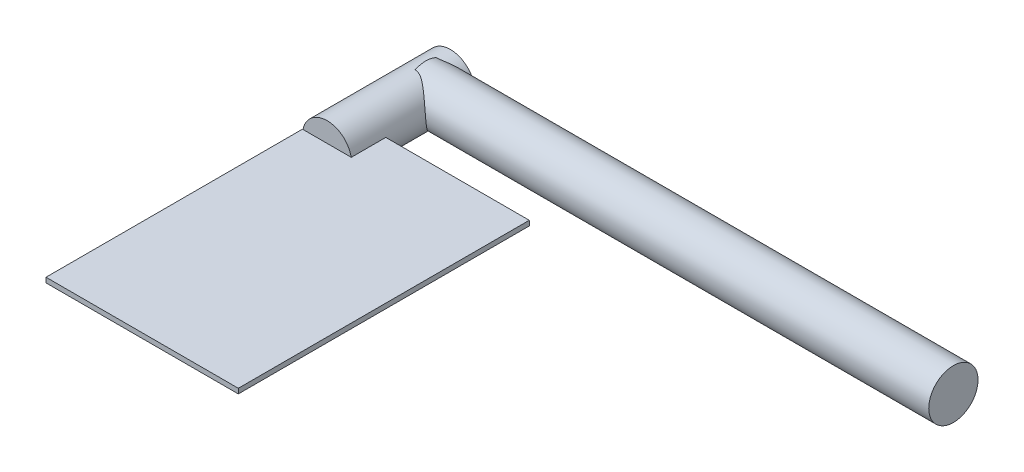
from build123d import *

# Parameters (mm, degrees)
SKETCH1_W           = 39
SKETCH1_H           = 59
BOSS_EXTRUDE1_DEPTH = 1
SKETCH6_R           = 5
BOSS_EXTRUDE2_DEPTH = 25
SKETCH8_R           = 5
BOSS_EXTRUDE3_DEPTH = 107


with BuildPart() as part:
    # Sketch1 → Boss-Extrude1 (new body)
    with BuildSketch(Plane(origin=(0, 0, 0), x_dir=(1, 0, 0), z_dir=(0, 1, 0))):
        with Locations((19.5, 29.5)):
            Rectangle(SKETCH1_W, SKETCH1_H)
    extrude(amount=BOSS_EXTRUDE1_DEPTH)

    # Sketch6 → Boss-Extrude2 (add)
    with BuildSketch(Plane(origin=(0, 0, -52), x_dir=(-1, 0, 0), z_dir=(0, 0, -1))):
        with Locations((-5, 0)):
            Circle(SKETCH6_R)
    extrude(amount=BOSS_EXTRUDE2_DEPTH)

    # Sketch8 → Boss-Extrude3 (add)
    with BuildSketch(Plane.ZY.offset(-5)):
        with Locations((-72, 0.48187131)):
            Circle(SKETCH8_R)
    extrude(amount=-BOSS_EXTRUDE3_DEPTH)


solid = part.part
